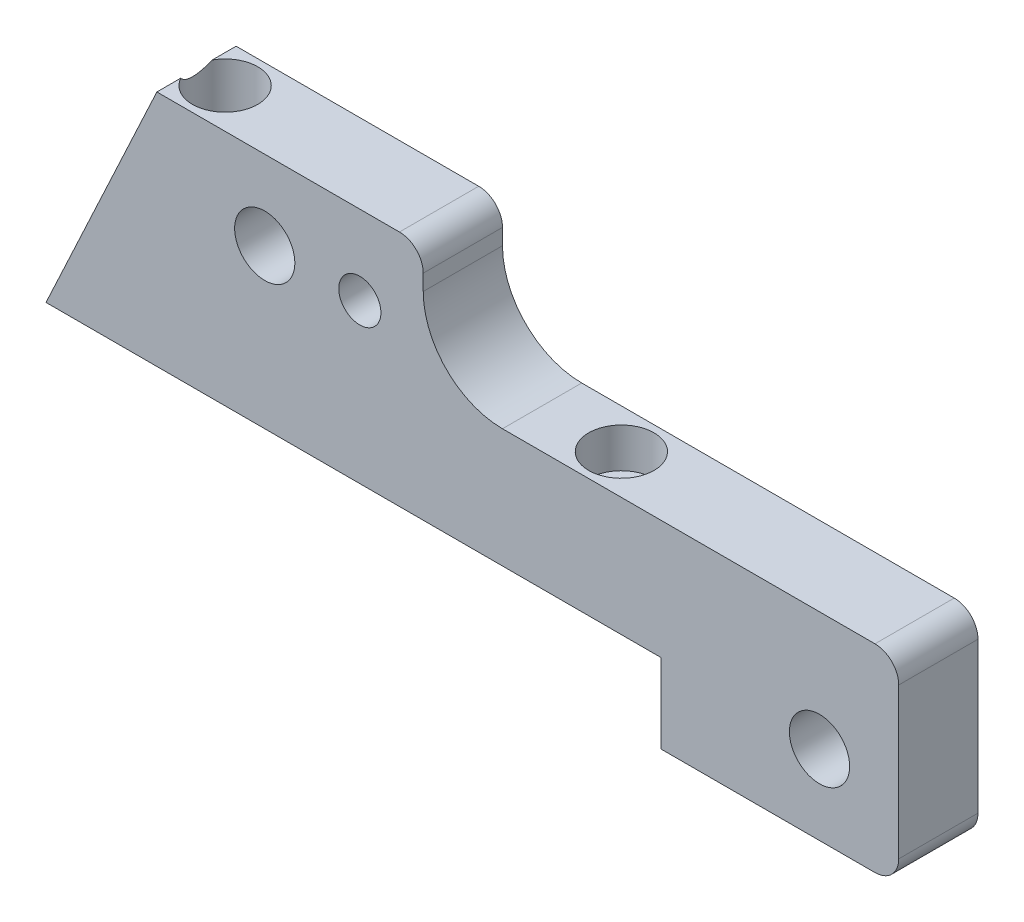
from build123d import *

# Parameters (mm, degrees)
SKETCH1_R                                         = 4.826
BOSS_EXTRUDE1_DEPTH                               = 6.35
CBORE_FOR_1_4_PAN_HEAD_MACHINE_SCREW2_D           = 6.7564
CBORE_FOR_1_4_PAN_HEAD_MACHINE_SCREW2_CBORE_D     = 10.4648
CBORE_FOR_1_4_PAN_HEAD_MACHINE_SCREW2_CBORE_DEPTH = 19.05
CBORE_FOR_1_4_PAN_HEAD_MACHINE_SCREW3_D           = 6.7564
CBORE_FOR_1_4_PAN_HEAD_MACHINE_SCREW3_CBORE_D     = 10.4648
CBORE_FOR_1_4_PAN_HEAD_MACHINE_SCREW3_CBORE_DEPTH = 6.35
CBORE_FOR_1_4_PAN_HEAD_MACHINE_SCREW4_D           = 6.7564
CBORE_FOR_1_4_PAN_HEAD_MACHINE_SCREW4_DEPTH       = 17.526
CBORE_FOR_1_4_PAN_HEAD_MACHINE_SCREW4_CBORE_D     = 13.49248
CBORE_FOR_1_4_PAN_HEAD_MACHINE_SCREW4_CBORE_DEPTH = 6.35
CBORE_FOR_1_4_PAN_HEAD_MACHINE_SCREW4_TIP         = 2.029827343


with BuildPart() as part:
    # Sketch1 → Boss-Extrude1 (new, symmetric)
    with BuildSketch(Plane.XY):
        with BuildLine():
            Line((0, 0), (-98.552, 0))
            Line((-98.552, 0), (-80.785678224, 38.1))
            Line((-80.785678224, 38.1), (-41.91, 38.1))
            ThreePointArc((-41.91, 38.1), (-39.215923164, 36.984076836), (-38.1, 34.29))
            Line((-38.1, 34.29), (-38.1, 31.75))
            ThreePointArc((-38.1, 31.75), (-34.380256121, 22.769743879), (-25.4, 19.05))
            Line((-25.4, 19.05), (34.29, 19.05))
            ThreePointArc((34.29, 19.05), (36.984076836, 17.934076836), (38.1, 15.24))
            Line((38.1, 15.24), (38.1, -8.89))
            ThreePointArc((38.1, -8.89), (36.984076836, -11.584076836), (34.29, -12.7))
            Line((34.29, -12.7), (0, -12.7))
            Line((0, -12.7), (0, 0))
        make_face()
        with Locations((-63.5, 25.4)):
            Circle(SKETCH1_R, mode=Mode.SUBTRACT)
        with Locations((25.4, 0)):
            Circle(SKETCH1_R, mode=Mode.SUBTRACT)
    extrude(amount=BOSS_EXTRUDE1_DEPTH, both=True)

    # CBORE for 1_4 Pan Head Machine Screw2 (through all)
    with Locations(Plane(origin=(0, 38.1, 0), x_dir=(1, 0, 0), z_dir=(0, 1, 0))):
        with Locations((-76.2, 0)):
            CounterBoreHole(CBORE_FOR_1_4_PAN_HEAD_MACHINE_SCREW2_D / 2, CBORE_FOR_1_4_PAN_HEAD_MACHINE_SCREW2_CBORE_D / 2, CBORE_FOR_1_4_PAN_HEAD_MACHINE_SCREW2_CBORE_DEPTH)

    # CBORE for 1_4 Pan Head Machine Screw3 (through all)
    with Locations(Plane(origin=(0, 19.05, 0), x_dir=(1, 0, 0), z_dir=(0, 1, 0))):
        with Locations((-12.7, 0)):
            CounterBoreHole(CBORE_FOR_1_4_PAN_HEAD_MACHINE_SCREW3_D / 2, CBORE_FOR_1_4_PAN_HEAD_MACHINE_SCREW3_CBORE_D / 2, CBORE_FOR_1_4_PAN_HEAD_MACHINE_SCREW3_CBORE_DEPTH)

    # CBORE for 1_4 Pan Head Machine Screw4
    with Locations(Plane(origin=(0, 0, -6.35), x_dir=(-1, 0, 0), z_dir=(0, 0, -1))):
        with Locations((48.26, 25.4)):
            CounterBoreHole(CBORE_FOR_1_4_PAN_HEAD_MACHINE_SCREW4_D / 2, CBORE_FOR_1_4_PAN_HEAD_MACHINE_SCREW4_CBORE_D / 2, CBORE_FOR_1_4_PAN_HEAD_MACHINE_SCREW4_CBORE_DEPTH, depth=CBORE_FOR_1_4_PAN_HEAD_MACHINE_SCREW4_DEPTH)
            with Locations((0, 0, -(CBORE_FOR_1_4_PAN_HEAD_MACHINE_SCREW4_DEPTH + CBORE_FOR_1_4_PAN_HEAD_MACHINE_SCREW4_TIP / 2))):  # 118° drill point
                Cone(0, CBORE_FOR_1_4_PAN_HEAD_MACHINE_SCREW4_D / 2, CBORE_FOR_1_4_PAN_HEAD_MACHINE_SCREW4_TIP, mode=Mode.SUBTRACT)


solid = part.part
